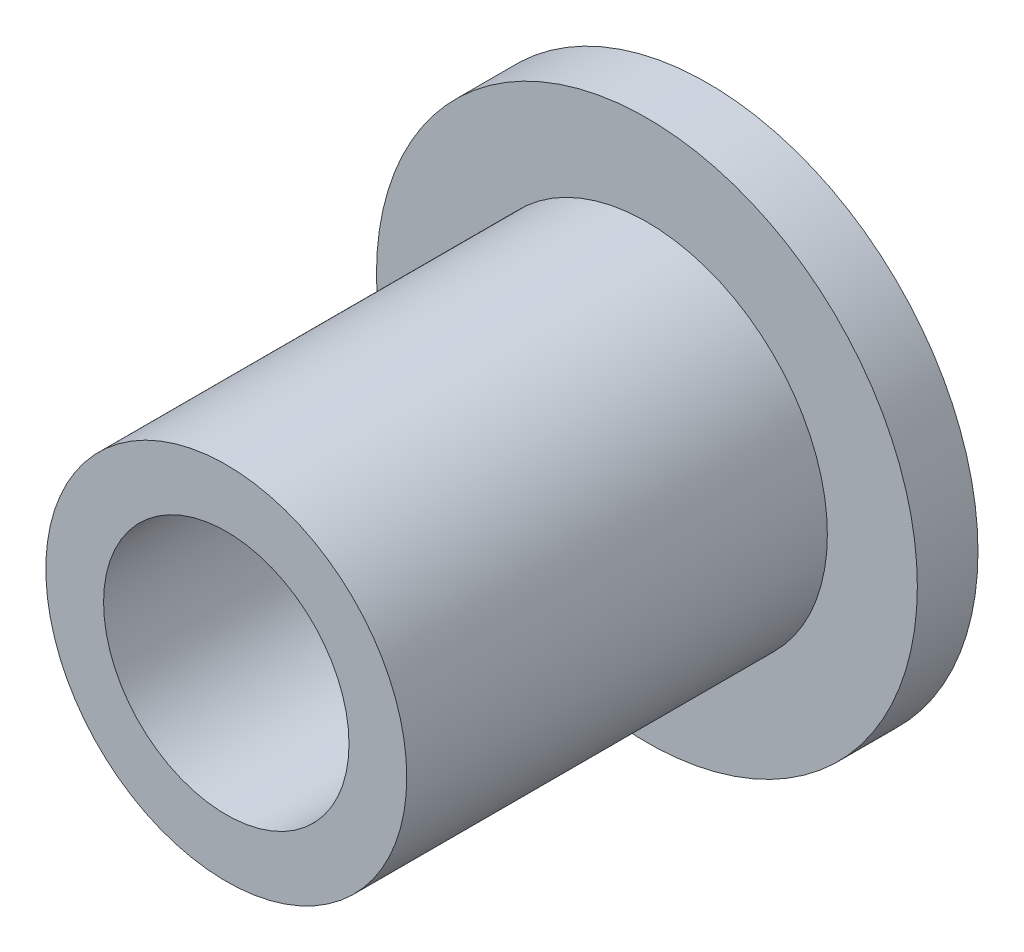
ISO-10303-21;
HEADER;
FILE_DESCRIPTION(('STEP AP214'),'2;1');
FILE_NAME('part.step','',(''),(''),'','','');
FILE_SCHEMA(('AUTOMOTIVE_DESIGN { 1 0 10303 214 1 1 1 1 }'));
ENDSEC;
DATA;
#1=APPLICATION_CONTEXT('core data for automotive mechanical design processes');
#2=APPLICATION_PROTOCOL_DEFINITION('international standard','automotive_design',2000,#1);
#3=PRODUCT_CONTEXT('',#1,'mechanical');
#4=PRODUCT('Part','Part','',(#3));
#5=PRODUCT_RELATED_PRODUCT_CATEGORY('part','',(#4));
#6=PRODUCT_DEFINITION_FORMATION('','',#4);
#7=PRODUCT_DEFINITION_CONTEXT('part definition',#1,'design');
#8=PRODUCT_DEFINITION('design','',#6,#7);
#9=PRODUCT_DEFINITION_SHAPE('','',#8);
#10=(LENGTH_UNIT() NAMED_UNIT(*) SI_UNIT(.MILLI.,.METRE.));
#11=(NAMED_UNIT(*) PLANE_ANGLE_UNIT() SI_UNIT($,.RADIAN.));
#12=(NAMED_UNIT(*) SI_UNIT($,.STERADIAN.) SOLID_ANGLE_UNIT());
#13=UNCERTAINTY_MEASURE_WITH_UNIT(LENGTH_MEASURE(1.E-05),#10,'distance_accuracy_value','');
#14=(GEOMETRIC_REPRESENTATION_CONTEXT(3) GLOBAL_UNCERTAINTY_ASSIGNED_CONTEXT((#13)) GLOBAL_UNIT_ASSIGNED_CONTEXT((#10,
#11,#12)) REPRESENTATION_CONTEXT('',''));
#15=CARTESIAN_POINT('',(0.,0.,0.));
#16=DIRECTION('',(0.,0.,1.));
#17=DIRECTION('',(1.,0.,0.));
#18=AXIS2_PLACEMENT_3D('',#15,#16,#17);
#19=CARTESIAN_POINT('',(0.,0.,12.7));
#20=DIRECTION('',(0.,0.,-1.));
#21=DIRECTION('',(-1.,0.,0.));
#22=AXIS2_PLACEMENT_3D('',#19,#20,#21);
#23=CYLINDRICAL_SURFACE('',#22,4.7625);
#24=CARTESIAN_POINT('',(0.,0.,1.6002));
#25=DIRECTION('',(0.,0.,-1.));
#26=DIRECTION('',(-1.,0.,0.));
#27=AXIS2_PLACEMENT_3D('',#24,#25,#26);
#28=CIRCLE('',#27,4.7625);
#29=CARTESIAN_POINT('',(4.7625,0.,1.6002));
#30=VERTEX_POINT('',#29);
#31=EDGE_CURVE('E11',#30,#30,#28,.T.);
#32=ORIENTED_EDGE('',*,*,#31,.F.);
#33=EDGE_LOOP('',(#32));
#34=FACE_BOUND('',#33,.T.);
#35=CARTESIAN_POINT('',(0.,0.,12.7));
#36=DIRECTION('',(0.,0.,1.));
#37=DIRECTION('',(-1.,0.,0.));
#38=AXIS2_PLACEMENT_3D('',#35,#36,#37);
#39=CIRCLE('',#38,4.7625);
#40=CARTESIAN_POINT('',(4.7625,0.,12.7));
#41=VERTEX_POINT('',#40);
#42=EDGE_CURVE('E62',#41,#41,#39,.T.);
#43=ORIENTED_EDGE('',*,*,#42,.F.);
#44=EDGE_LOOP('',(#43));
#45=FACE_BOUND('',#44,.T.);
#46=ADVANCED_FACE('F16',(#34,#45),#23,.T.);
#47=CARTESIAN_POINT('',(0.562448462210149,0.,1.6002));
#48=DIRECTION('',(0.,0.,-1.));
#49=DIRECTION('',(1.,0.,0.));
#50=AXIS2_PLACEMENT_3D('',#47,#48,#49);
#51=PLANE('',#50);
#52=CARTESIAN_POINT('',(0.,0.,1.6002));
#53=DIRECTION('',(0.,0.,-1.));
#54=DIRECTION('',(1.,0.,0.));
#55=AXIS2_PLACEMENT_3D('',#52,#53,#54);
#56=CIRCLE('',#55,7.1374);
#57=CARTESIAN_POINT('',(7.1374,0.,1.6002));
#58=VERTEX_POINT('',#57);
#59=EDGE_CURVE('E19',#58,#58,#56,.T.);
#60=ORIENTED_EDGE('',*,*,#59,.F.);
#61=EDGE_LOOP('',(#60));
#62=FACE_BOUND('',#61,.T.);
#63=ORIENTED_EDGE('',*,*,#31,.T.);
#64=EDGE_LOOP('',(#63));
#65=FACE_BOUND('',#64,.T.);
#66=ADVANCED_FACE('F77',(#62,#65),#51,.F.);
#67=CARTESIAN_POINT('',(0.,0.,0.));
#68=DIRECTION('',(0.,0.,1.));
#69=DIRECTION('',(-1.,0.,0.));
#70=AXIS2_PLACEMENT_3D('',#67,#68,#69);
#71=CYLINDRICAL_SURFACE('',#70,3.2385);
#72=CARTESIAN_POINT('',(0.,0.,12.7));
#73=DIRECTION('',(0.,0.,1.));
#74=DIRECTION('',(-1.,0.,0.));
#75=AXIS2_PLACEMENT_3D('',#72,#73,#74);
#76=CIRCLE('',#75,3.2385);
#77=CARTESIAN_POINT('',(3.2385,0.,12.7));
#78=VERTEX_POINT('',#77);
#79=EDGE_CURVE('E26',#78,#78,#76,.T.);
#80=ORIENTED_EDGE('',*,*,#79,.T.);
#81=EDGE_LOOP('',(#80));
#82=FACE_BOUND('',#81,.T.);
#83=CARTESIAN_POINT('',(0.,0.,0.));
#84=DIRECTION('',(0.,0.,-1.));
#85=DIRECTION('',(-1.,0.,0.));
#86=AXIS2_PLACEMENT_3D('',#83,#84,#85);
#87=CIRCLE('',#86,3.2385);
#88=CARTESIAN_POINT('',(3.2385,0.,0.));
#89=VERTEX_POINT('',#88);
#90=EDGE_CURVE('E65',#89,#89,#87,.T.);
#91=ORIENTED_EDGE('',*,*,#90,.T.);
#92=EDGE_LOOP('',(#91));
#93=FACE_BOUND('',#92,.T.);
#94=ADVANCED_FACE('F73',(#82,#93),#71,.F.);
#95=CARTESIAN_POINT('',(0.,0.,0.));
#96=DIRECTION('',(0.,0.,1.));
#97=DIRECTION('',(1.,0.,0.));
#98=AXIS2_PLACEMENT_3D('',#95,#96,#97);
#99=CYLINDRICAL_SURFACE('',#98,7.1374);
#100=ORIENTED_EDGE('',*,*,#59,.T.);
#101=EDGE_LOOP('',(#100));
#102=FACE_BOUND('',#101,.T.);
#103=CARTESIAN_POINT('',(0.,0.,0.));
#104=DIRECTION('',(0.,0.,1.));
#105=DIRECTION('',(1.,0.,0.));
#106=AXIS2_PLACEMENT_3D('',#103,#104,#105);
#107=CIRCLE('',#106,7.1374);
#108=CARTESIAN_POINT('',(7.1374,0.,0.));
#109=VERTEX_POINT('',#108);
#110=EDGE_CURVE('E57',#109,#109,#107,.T.);
#111=ORIENTED_EDGE('',*,*,#110,.T.);
#112=EDGE_LOOP('',(#111));
#113=FACE_BOUND('',#112,.T.);
#114=ADVANCED_FACE('F76',(#102,#113),#99,.T.);
#115=CARTESIAN_POINT('',(0.538225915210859,0.,12.7));
#116=DIRECTION('',(0.,0.,1.));
#117=DIRECTION('',(1.,0.,0.));
#118=AXIS2_PLACEMENT_3D('',#115,#116,#117);
#119=PLANE('',#118);
#120=ORIENTED_EDGE('',*,*,#42,.T.);
#121=EDGE_LOOP('',(#120));
#122=FACE_BOUND('',#121,.T.);
#123=ORIENTED_EDGE('',*,*,#79,.F.);
#124=EDGE_LOOP('',(#123));
#125=FACE_BOUND('',#124,.T.);
#126=ADVANCED_FACE('F80',(#122,#125),#119,.T.);
#127=CARTESIAN_POINT('',(0.538225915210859,0.,0.));
#128=DIRECTION('',(0.,0.,1.));
#129=DIRECTION('',(1.,0.,0.));
#130=AXIS2_PLACEMENT_3D('',#127,#128,#129);
#131=PLANE('',#130);
#132=ORIENTED_EDGE('',*,*,#110,.F.);
#133=EDGE_LOOP('',(#132));
#134=FACE_BOUND('',#133,.T.);
#135=ORIENTED_EDGE('',*,*,#90,.F.);
#136=EDGE_LOOP('',(#135));
#137=FACE_BOUND('',#136,.T.);
#138=ADVANCED_FACE('F58',(#134,#137),#131,.F.);
#139=CLOSED_SHELL('',(#46,#66,#94,#114,#126,#138));
#140=MANIFOLD_SOLID_BREP('B1',#139);
#141=ADVANCED_BREP_SHAPE_REPRESENTATION('',(#18,#140),#14);
#142=SHAPE_DEFINITION_REPRESENTATION(#9,#141);
ENDSEC;
END-ISO-10303-21;
